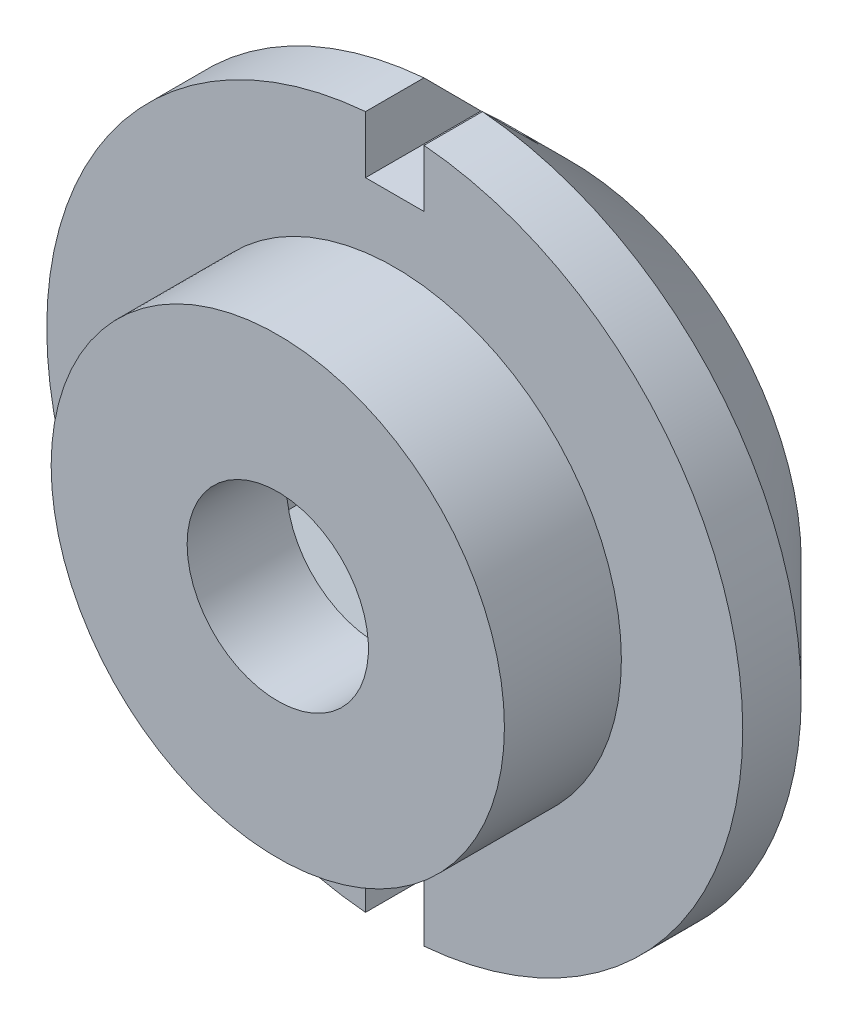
ISO-10303-21;
HEADER;
FILE_DESCRIPTION(('STEP AP214'),'2;1');
FILE_NAME('part.step','',(''),(''),'','','');
FILE_SCHEMA(('AUTOMOTIVE_DESIGN { 1 0 10303 214 1 1 1 1 }'));
ENDSEC;
DATA;
#1=APPLICATION_CONTEXT('core data for automotive mechanical design processes');
#2=APPLICATION_PROTOCOL_DEFINITION('international standard','automotive_design',2000,#1);
#3=PRODUCT_CONTEXT('',#1,'mechanical');
#4=PRODUCT('Part','Part','',(#3));
#5=PRODUCT_RELATED_PRODUCT_CATEGORY('part','',(#4));
#6=PRODUCT_DEFINITION_FORMATION('','',#4);
#7=PRODUCT_DEFINITION_CONTEXT('part definition',#1,'design');
#8=PRODUCT_DEFINITION('design','',#6,#7);
#9=PRODUCT_DEFINITION_SHAPE('','',#8);
#10=(LENGTH_UNIT() NAMED_UNIT(*) SI_UNIT(.MILLI.,.METRE.));
#11=(NAMED_UNIT(*) PLANE_ANGLE_UNIT() SI_UNIT($,.RADIAN.));
#12=(NAMED_UNIT(*) SI_UNIT($,.STERADIAN.) SOLID_ANGLE_UNIT());
#13=UNCERTAINTY_MEASURE_WITH_UNIT(LENGTH_MEASURE(1.E-05),#10,'distance_accuracy_value','');
#14=(GEOMETRIC_REPRESENTATION_CONTEXT(3) GLOBAL_UNCERTAINTY_ASSIGNED_CONTEXT((#13)) GLOBAL_UNIT_ASSIGNED_CONTEXT((#10,
#11,#12)) REPRESENTATION_CONTEXT('',''));
#15=CARTESIAN_POINT('',(0.,0.,0.));
#16=DIRECTION('',(0.,0.,1.));
#17=DIRECTION('',(1.,0.,0.));
#18=AXIS2_PLACEMENT_3D('',#15,#16,#17);
#19=CARTESIAN_POINT('',(0.,0.,1.5));
#20=DIRECTION('',(0.,0.,-1.));
#21=DIRECTION('',(-1.,0.,0.));
#22=AXIS2_PLACEMENT_3D('',#19,#20,#21);
#23=CYLINDRICAL_SURFACE('',#22,5.95);
#24=CARTESIAN_POINT('',(0.,0.,0.5));
#25=DIRECTION('',(0.,0.,1.));
#26=DIRECTION('',(1.,0.,0.));
#27=AXIS2_PLACEMENT_3D('',#24,#25,#26);
#28=CIRCLE('',#27,5.95);
#29=CARTESIAN_POINT('',(-0.5,5.92895437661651,0.5));
#30=VERTEX_POINT('',#29);
#31=CARTESIAN_POINT('',(-0.5,-5.92895437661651,0.5));
#32=VERTEX_POINT('',#31);
#33=EDGE_CURVE('E255',#30,#32,#28,.T.);
#34=ORIENTED_EDGE('',*,*,#33,.T.);
#35=DIRECTION('',(0.,0.,-1.));
#36=VECTOR('',#35,1.);
#37=CARTESIAN_POINT('',(-0.5,-5.92895437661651,1.5));
#38=LINE('',#37,#36);
#39=CARTESIAN_POINT('',(-0.5,-5.92895437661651,1.5));
#40=VERTEX_POINT('',#39);
#41=EDGE_CURVE('E185',#32,#40,#38,.F.);
#42=ORIENTED_EDGE('',*,*,#41,.T.);
#43=CARTESIAN_POINT('',(0.,0.,1.5));
#44=DIRECTION('',(0.,0.,1.));
#45=DIRECTION('',(1.,0.,0.));
#46=AXIS2_PLACEMENT_3D('',#43,#44,#45);
#47=CIRCLE('',#46,5.95);
#48=CARTESIAN_POINT('',(-0.5,5.92895437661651,1.5));
#49=VERTEX_POINT('',#48);
#50=EDGE_CURVE('E251',#49,#40,#47,.T.);
#51=ORIENTED_EDGE('',*,*,#50,.F.);
#52=DIRECTION('',(0.,0.,-1.));
#53=VECTOR('',#52,1.);
#54=CARTESIAN_POINT('',(-0.5,5.92895437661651,1.5));
#55=LINE('',#54,#53);
#56=EDGE_CURVE('E156',#49,#30,#55,.T.);
#57=ORIENTED_EDGE('',*,*,#56,.T.);
#58=EDGE_LOOP('',(#34,#42,#51,#57));
#59=FACE_BOUND('',#58,.T.);
#60=ADVANCED_FACE('F38',(#59),#23,.T.);
#61=CARTESIAN_POINT('',(0.5,-5.92895437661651,1.5));
#62=VERTEX_POINT('',#61);
#63=CARTESIAN_POINT('',(0.5,5.92895437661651,1.5));
#64=VERTEX_POINT('',#63);
#65=EDGE_CURVE('E168',#62,#64,#47,.T.);
#66=ORIENTED_EDGE('',*,*,#65,.F.);
#67=DIRECTION('',(0.,0.,-1.));
#68=VECTOR('',#67,1.);
#69=CARTESIAN_POINT('',(0.5,-5.92895437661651,1.5));
#70=LINE('',#69,#68);
#71=CARTESIAN_POINT('',(0.5,-5.92895437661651,0.5));
#72=VERTEX_POINT('',#71);
#73=EDGE_CURVE('E180',#62,#72,#70,.T.);
#74=ORIENTED_EDGE('',*,*,#73,.T.);
#75=CARTESIAN_POINT('',(0.5,5.92895437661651,0.5));
#76=VERTEX_POINT('',#75);
#77=EDGE_CURVE('E250',#72,#76,#28,.T.);
#78=ORIENTED_EDGE('',*,*,#77,.T.);
#79=DIRECTION('',(0.,0.,-1.));
#80=VECTOR('',#79,1.);
#81=CARTESIAN_POINT('',(0.5,5.92895437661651,1.5));
#82=LINE('',#81,#80);
#83=EDGE_CURVE('E67',#76,#64,#82,.F.);
#84=ORIENTED_EDGE('',*,*,#83,.T.);
#85=EDGE_LOOP('',(#66,#74,#78,#84));
#86=FACE_BOUND('',#85,.T.);
#87=ADVANCED_FACE('F324',(#86),#23,.T.);
#88=CARTESIAN_POINT('',(0.,0.,1.5));
#89=DIRECTION('',(0.,0.,1.));
#90=DIRECTION('',(1.,0.,0.));
#91=AXIS2_PLACEMENT_3D('',#88,#89,#90);
#92=PLANE('',#91);
#93=DIRECTION('',(0.,-1.,0.));
#94=VECTOR('',#93,1.);
#95=CARTESIAN_POINT('',(-0.5,0.,1.5));
#96=LINE('',#95,#94);
#97=CARTESIAN_POINT('',(-0.5,-4.95,1.5));
#98=VERTEX_POINT('',#97);
#99=EDGE_CURVE('E188',#98,#40,#96,.T.);
#100=ORIENTED_EDGE('',*,*,#99,.F.);
#101=DIRECTION('',(-1.,0.,0.));
#102=VECTOR('',#101,1.);
#103=CARTESIAN_POINT('',(0.,-4.95,1.5));
#104=LINE('',#103,#102);
#105=CARTESIAN_POINT('',(0.5,-4.95,1.5));
#106=VERTEX_POINT('',#105);
#107=EDGE_CURVE('E178',#106,#98,#104,.T.);
#108=ORIENTED_EDGE('',*,*,#107,.F.);
#109=DIRECTION('',(0.,1.,0.));
#110=VECTOR('',#109,1.);
#111=CARTESIAN_POINT('',(0.5,0.,1.5));
#112=LINE('',#111,#110);
#113=EDGE_CURVE('E183',#62,#106,#112,.T.);
#114=ORIENTED_EDGE('',*,*,#113,.F.);
#115=ORIENTED_EDGE('',*,*,#65,.T.);
#116=DIRECTION('',(0.,1.,0.));
#117=VECTOR('',#116,1.);
#118=CARTESIAN_POINT('',(0.5,0.,1.5));
#119=LINE('',#118,#117);
#120=CARTESIAN_POINT('',(0.5,4.95,1.5));
#121=VERTEX_POINT('',#120);
#122=EDGE_CURVE('E157',#121,#64,#119,.T.);
#123=ORIENTED_EDGE('',*,*,#122,.F.);
#124=DIRECTION('',(1.,0.,0.));
#125=VECTOR('',#124,1.);
#126=CARTESIAN_POINT('',(0.,4.95,1.5));
#127=LINE('',#126,#125);
#128=CARTESIAN_POINT('',(-0.5,4.95,1.5));
#129=VERTEX_POINT('',#128);
#130=EDGE_CURVE('E146',#129,#121,#127,.T.);
#131=ORIENTED_EDGE('',*,*,#130,.F.);
#132=DIRECTION('',(0.,-1.,0.));
#133=VECTOR('',#132,1.);
#134=CARTESIAN_POINT('',(-0.5,0.,1.5));
#135=LINE('',#134,#133);
#136=EDGE_CURVE('E176',#49,#129,#135,.T.);
#137=ORIENTED_EDGE('',*,*,#136,.F.);
#138=ORIENTED_EDGE('',*,*,#50,.T.);
#139=EDGE_LOOP('',(#100,#108,#114,#115,#123,#131,#137,#138));
#140=FACE_BOUND('',#139,.T.);
#141=CARTESIAN_POINT('',(0.,0.,1.5));
#142=DIRECTION('',(0.,0.,1.));
#143=DIRECTION('',(1.,0.,0.));
#144=AXIS2_PLACEMENT_3D('',#141,#142,#143);
#145=CIRCLE('',#144,3.875);
#146=CARTESIAN_POINT('',(3.875,0.,1.5));
#147=VERTEX_POINT('',#146);
#148=EDGE_CURVE('E247',#147,#147,#145,.T.);
#149=ORIENTED_EDGE('',*,*,#148,.F.);
#150=EDGE_LOOP('',(#149));
#151=FACE_BOUND('',#150,.T.);
#152=ADVANCED_FACE('F164',(#140,#151),#92,.T.);
#153=CARTESIAN_POINT('',(0.,0.,-1.5));
#154=DIRECTION('',(0.,0.,1.));
#155=DIRECTION('',(1.,0.,0.));
#156=AXIS2_PLACEMENT_3D('',#153,#154,#155);
#157=PLANE('',#156);
#158=DIRECTION('',(0.866025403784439,-0.5,0.));
#159=VECTOR('',#158,1.);
#160=CARTESIAN_POINT('',(0.,3.25,-1.5));
#161=LINE('',#160,#159);
#162=CARTESIAN_POINT('',(0.,3.25,-1.5));
#163=VERTEX_POINT('',#162);
#164=CARTESIAN_POINT('',(2.81458256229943,1.625,-1.5));
#165=VERTEX_POINT('',#164);
#166=EDGE_CURVE('E218',#163,#165,#161,.T.);
#167=ORIENTED_EDGE('',*,*,#166,.F.);
#168=DIRECTION('',(0.866025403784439,0.5,0.));
#169=VECTOR('',#168,1.);
#170=CARTESIAN_POINT('',(-2.81458256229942,1.625,-1.5));
#171=LINE('',#170,#169);
#172=CARTESIAN_POINT('',(-2.81458256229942,1.625,-1.5));
#173=VERTEX_POINT('',#172);
#174=EDGE_CURVE('E194',#173,#163,#171,.T.);
#175=ORIENTED_EDGE('',*,*,#174,.F.);
#176=DIRECTION('',(0.,1.,0.));
#177=VECTOR('',#176,1.);
#178=CARTESIAN_POINT('',(-2.81458256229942,-1.625,-1.5));
#179=LINE('',#178,#177);
#180=CARTESIAN_POINT('',(-2.81458256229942,-1.625,-1.5));
#181=VERTEX_POINT('',#180);
#182=EDGE_CURVE('E201',#181,#173,#179,.T.);
#183=ORIENTED_EDGE('',*,*,#182,.F.);
#184=DIRECTION('',(-0.866025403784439,0.5,0.));
#185=VECTOR('',#184,1.);
#186=CARTESIAN_POINT('',(0.,-3.25,-1.5));
#187=LINE('',#186,#185);
#188=CARTESIAN_POINT('',(0.,-3.25,-1.5));
#189=VERTEX_POINT('',#188);
#190=EDGE_CURVE('E227',#189,#181,#187,.T.);
#191=ORIENTED_EDGE('',*,*,#190,.F.);
#192=DIRECTION('',(-0.866025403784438,-0.5,0.));
#193=VECTOR('',#192,1.);
#194=CARTESIAN_POINT('',(2.81458256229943,-1.625,-1.5));
#195=LINE('',#194,#193);
#196=CARTESIAN_POINT('',(2.81458256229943,-1.625,-1.5));
#197=VERTEX_POINT('',#196);
#198=EDGE_CURVE('E224',#197,#189,#195,.T.);
#199=ORIENTED_EDGE('',*,*,#198,.F.);
#200=DIRECTION('',(0.,-1.,0.));
#201=VECTOR('',#200,1.);
#202=CARTESIAN_POINT('',(2.81458256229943,1.625,-1.5));
#203=LINE('',#202,#201);
#204=EDGE_CURVE('E221',#165,#197,#203,.T.);
#205=ORIENTED_EDGE('',*,*,#204,.F.);
#206=EDGE_LOOP('',(#167,#175,#183,#191,#199,#205));
#207=FACE_BOUND('',#206,.T.);
#208=CARTESIAN_POINT('',(0.,0.,-1.5));
#209=DIRECTION('',(0.,0.,1.));
#210=DIRECTION('',(1.,0.,0.));
#211=AXIS2_PLACEMENT_3D('',#208,#209,#210);
#212=CIRCLE('',#211,3.95);
#213=CARTESIAN_POINT('',(3.95,0.,-1.5));
#214=VERTEX_POINT('',#213);
#215=EDGE_CURVE('E256',#214,#214,#212,.F.);
#216=ORIENTED_EDGE('',*,*,#215,.T.);
#217=EDGE_LOOP('',(#216));
#218=FACE_BOUND('',#217,.T.);
#219=ADVANCED_FACE('F320',(#207,#218),#157,.F.);
#220=CARTESIAN_POINT('',(0.,0.,3.5));
#221=DIRECTION('',(0.,0.,-1.));
#222=DIRECTION('',(-1.,0.,0.));
#223=AXIS2_PLACEMENT_3D('',#220,#221,#222);
#224=CYLINDRICAL_SURFACE('',#223,3.875);
#225=CARTESIAN_POINT('',(0.,0.,3.5));
#226=DIRECTION('',(0.,0.,1.));
#227=DIRECTION('',(1.,0.,0.));
#228=AXIS2_PLACEMENT_3D('',#225,#226,#227);
#229=CIRCLE('',#228,3.875);
#230=CARTESIAN_POINT('',(3.875,0.,3.5));
#231=VERTEX_POINT('',#230);
#232=EDGE_CURVE('E234',#231,#231,#229,.T.);
#233=ORIENTED_EDGE('',*,*,#232,.F.);
#234=EDGE_LOOP('',(#233));
#235=FACE_BOUND('',#234,.T.);
#236=ORIENTED_EDGE('',*,*,#148,.T.);
#237=EDGE_LOOP('',(#236));
#238=FACE_BOUND('',#237,.T.);
#239=ADVANCED_FACE('F316',(#235,#238),#224,.T.);
#240=CARTESIAN_POINT('',(0.,0.,3.5));
#241=DIRECTION('',(0.,0.,1.));
#242=DIRECTION('',(1.,0.,0.));
#243=AXIS2_PLACEMENT_3D('',#240,#241,#242);
#244=PLANE('',#243);
#245=CARTESIAN_POINT('',(0.,0.,3.5));
#246=DIRECTION('',(0.,0.,-1.));
#247=DIRECTION('',(-1.,0.,0.));
#248=AXIS2_PLACEMENT_3D('',#245,#246,#247);
#249=CIRCLE('',#248,1.55);
#250=CARTESIAN_POINT('',(-1.55,0.,3.5));
#251=VERTEX_POINT('',#250);
#252=EDGE_CURVE('E191',#251,#251,#249,.T.);
#253=ORIENTED_EDGE('',*,*,#252,.T.);
#254=EDGE_LOOP('',(#253));
#255=FACE_BOUND('',#254,.T.);
#256=ORIENTED_EDGE('',*,*,#232,.T.);
#257=EDGE_LOOP('',(#256));
#258=FACE_BOUND('',#257,.T.);
#259=ADVANCED_FACE('F313',(#255,#258),#244,.T.);
#260=CARTESIAN_POINT('',(0.,0.,0.5));
#261=DIRECTION('',(0.,0.,1.));
#262=DIRECTION('',(1.,0.,0.));
#263=AXIS2_PLACEMENT_3D('',#260,#261,#262);
#264=CONICAL_SURFACE('',#263,5.95,0.78539816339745);
#265=CARTESIAN_POINT('',(-0.5,-8.17098423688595,2.73626797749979));
#266=CARTESIAN_POINT('',(-0.5,-7.71703063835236,2.28320845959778));
#267=CARTESIAN_POINT('',(-0.5,-7.26304841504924,1.8301773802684));
#268=CARTESIAN_POINT('',(-0.5,-6.3548317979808,0.924369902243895));
#269=CARTESIAN_POINT('',(-0.5,-5.90059740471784,0.471593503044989));
#270=CARTESIAN_POINT('',(-0.5,-5.21890848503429,-0.207233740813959));
#271=CARTESIAN_POINT('',(-0.5,-4.99162229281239,-0.433453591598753));
#272=CARTESIAN_POINT('',(-0.5,-4.53687572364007,-0.885717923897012));
#273=CARTESIAN_POINT('',(-0.5,-4.30941534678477,-1.11176240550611));
#274=CARTESIAN_POINT('',(-0.5,-3.85422354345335,-1.56357955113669));
#275=CARTESIAN_POINT('',(-0.5,-3.62649211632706,-1.78935221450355));
#276=CARTESIAN_POINT('',(-0.5,-3.28454462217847,-2.12765761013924));
#277=CARTESIAN_POINT('',(-0.5,-3.17050362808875,-2.24036724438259));
#278=CARTESIAN_POINT('',(-0.5,-2.94225511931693,-2.4656179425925));
#279=CARTESIAN_POINT('',(-0.5,-2.82804760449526,-2.57815900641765));
#280=CARTESIAN_POINT('',(-0.5,-2.71373202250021,-2.69059037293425));
#281=B_SPLINE_CURVE_WITH_KNOTS('',3,(#265,#266,#267,#268,#269,#270,#271,#272,#273,#274,#275,
#276,#277,#278,#279,#280),.UNSPECIFIED.,.F.,.F.,(4,2,2,2,2,2,2,4),(0.,1.92406659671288,
3.84812937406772,4.8101635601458,5.77219722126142,6.73423319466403,7.21525205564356,
7.69627131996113),.UNSPECIFIED.);
#282=CARTESIAN_POINT('',(-0.500000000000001,-4.95,-0.474811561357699));
#283=VERTEX_POINT('',#282);
#284=EDGE_CURVE('E11',#32,#283,#281,.T.);
#285=ORIENTED_EDGE('',*,*,#284,.F.);
#286=ORIENTED_EDGE('',*,*,#33,.F.);
#287=CARTESIAN_POINT('',(-0.5,2.71373202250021,-2.69059037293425));
#288=CARTESIAN_POINT('',(-0.5,2.9057894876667,-2.50166112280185));
#289=CARTESIAN_POINT('',(-0.5,3.0975722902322,-2.31245347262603));
#290=CARTESIAN_POINT('',(-0.5,3.48075238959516,-1.93364875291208));
#291=CARTESIAN_POINT('',(-0.5,3.6721496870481,-1.74405168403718));
#292=CARTESIAN_POINT('',(-0.5,4.05472280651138,-1.36463530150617));
#293=CARTESIAN_POINT('',(-0.5,4.24589862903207,-1.17481598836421));
#294=CARTESIAN_POINT('',(-0.5,4.62809640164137,-0.795022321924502));
#295=CARTESIAN_POINT('',(-0.5,4.81911835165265,-0.605047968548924));
#296=CARTESIAN_POINT('',(-0.5,5.53740915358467,0.109685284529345));
#297=CARTESIAN_POINT('',(-0.5,6.06434177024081,0.634782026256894));
#298=CARTESIAN_POINT('',(-0.5,6.85449168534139,1.42267816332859));
#299=CARTESIAN_POINT('',(-0.5,7.11783386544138,1.68535242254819));
#300=CARTESIAN_POINT('',(-0.5,7.64445321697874,2.21076598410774));
#301=CARTESIAN_POINT('',(-0.5,7.90773038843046,2.47350528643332));
#302=CARTESIAN_POINT('',(-0.499999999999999,8.17098423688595,2.73626797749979));
#303=B_SPLINE_CURVE_WITH_KNOTS('',3,(#287,#288,#289,#290,#291,#292,#293,#294,#295,#296,#297,
#298,#299,#300,#301,#302),.UNSPECIFIED.,.F.,.F.,(4,2,2,2,2,2,2,4),(0.,0.808221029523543,
1.61644068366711,2.42465847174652,3.23287666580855,5.46457084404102,6.58042112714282,
7.69627116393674),.UNSPECIFIED.);
#304=CARTESIAN_POINT('',(-0.5,4.95,-0.474811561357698));
#305=VERTEX_POINT('',#304);
#306=EDGE_CURVE('E341',#305,#30,#303,.T.);
#307=ORIENTED_EDGE('',*,*,#306,.F.);
#308=CARTESIAN_POINT('',(2.73626797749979,4.95,0.205940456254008));
#309=CARTESIAN_POINT('',(2.54686897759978,4.95,0.11437680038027));
#310=CARTESIAN_POINT('',(2.35437597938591,4.95,0.0284706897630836));
#311=CARTESIAN_POINT('',(1.96226783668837,4.95,-0.128312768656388));
#312=CARTESIAN_POINT('',(1.76262116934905,4.95,-0.19911059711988));
#313=CARTESIAN_POINT('',(1.36013508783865,4.95,-0.320061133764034));
#314=CARTESIAN_POINT('',(1.15738288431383,4.95,-0.37049611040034));
#315=CARTESIAN_POINT('',(0.747761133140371,4.95,-0.447858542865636));
#316=CARTESIAN_POINT('',(0.540901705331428,4.95,-0.474837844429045));
#317=CARTESIAN_POINT('',(0.17846488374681,4.95,-0.499198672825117));
#318=CARTESIAN_POINT('',(0.0232630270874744,4.95,-0.502373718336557));
#319=CARTESIAN_POINT('',(-0.286810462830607,4.95,-0.494118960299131));
#320=CARTESIAN_POINT('',(-0.441681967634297,4.95,-0.482684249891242));
#321=CARTESIAN_POINT('',(-0.749872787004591,4.95,-0.445866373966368));
#322=CARTESIAN_POINT('',(-0.903190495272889,4.95,-0.42047002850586));
#323=CARTESIAN_POINT('',(-1.20715818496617,4.95,-0.357100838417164));
#324=CARTESIAN_POINT('',(-1.35780840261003,4.95,-0.319129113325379));
#325=CARTESIAN_POINT('',(-1.61280977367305,4.95,-0.244871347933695));
#326=CARTESIAN_POINT('',(-1.71795950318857,4.95,-0.211269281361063));
#327=CARTESIAN_POINT('',(-1.92656749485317,4.95,-0.139201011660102));
#328=CARTESIAN_POINT('',(-2.03002588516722,4.95,-0.100735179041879));
#329=CARTESIAN_POINT('',(-2.23491090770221,4.95,-0.0196690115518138));
#330=CARTESIAN_POINT('',(-2.33634302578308,4.95,0.0229175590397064));
#331=CARTESIAN_POINT('',(-2.53753600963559,4.95,0.11178664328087));
#332=CARTESIAN_POINT('',(-2.63729744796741,4.95,0.158067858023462));
#333=CARTESIAN_POINT('',(-2.73626797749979,4.95,0.205940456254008));
#334=B_SPLINE_CURVE_WITH_KNOTS('',3,(#308,#309,#310,#311,#312,#313,#314,#315,#316,#317,#318,
#319,#320,#321,#322,#323,#324,#325,#326,#327,#328,#329,#330,#331,#332,#333),.UNSPECIFIED.,.F.,
.F.,(4,2,2,2,2,2,2,2,2,2,2,2,4),(0.,0.631508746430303,1.26626352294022,1.89188945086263,
2.5161289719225,2.98117104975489,3.44636935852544,3.91200757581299,4.3776043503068,
4.70865054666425,5.03967153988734,5.36962269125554,5.69945834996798),.UNSPECIFIED.);
#335=CARTESIAN_POINT('',(0.5,4.95,-0.474811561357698));
#336=VERTEX_POINT('',#335);
#337=EDGE_CURVE('E265',#336,#305,#334,.T.);
#338=ORIENTED_EDGE('',*,*,#337,.F.);
#339=CARTESIAN_POINT('',(0.500000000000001,8.17098423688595,2.73626797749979));
#340=CARTESIAN_POINT('',(0.500000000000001,7.71703063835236,2.28320845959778));
#341=CARTESIAN_POINT('',(0.500000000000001,7.26304841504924,1.8301773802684));
#342=CARTESIAN_POINT('',(0.5,6.3548317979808,0.924369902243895));
#343=CARTESIAN_POINT('',(0.5,5.90059740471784,0.47159350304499));
#344=CARTESIAN_POINT('',(0.5,5.21890848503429,-0.207233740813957));
#345=CARTESIAN_POINT('',(0.5,4.99162229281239,-0.433453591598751));
#346=CARTESIAN_POINT('',(0.5,4.53687572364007,-0.885717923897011));
#347=CARTESIAN_POINT('',(0.5,4.30941534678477,-1.11176240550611));
#348=CARTESIAN_POINT('',(0.5,3.85422354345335,-1.56357955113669));
#349=CARTESIAN_POINT('',(0.5,3.62649211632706,-1.78935221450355));
#350=CARTESIAN_POINT('',(0.5,3.28454462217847,-2.12765761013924));
#351=CARTESIAN_POINT('',(0.5,3.17050362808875,-2.24036724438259));
#352=CARTESIAN_POINT('',(0.5,2.94225511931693,-2.4656179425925));
#353=CARTESIAN_POINT('',(0.5,2.82804760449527,-2.57815900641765));
#354=CARTESIAN_POINT('',(0.5,2.71373202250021,-2.69059037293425));
#355=B_SPLINE_CURVE_WITH_KNOTS('',3,(#339,#340,#341,#342,#343,#344,#345,#346,#347,#348,#349,
#350,#351,#352,#353,#354),.UNSPECIFIED.,.F.,.F.,(4,2,2,2,2,2,2,4),(0.,1.92406659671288,
3.84812937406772,4.8101635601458,5.77219722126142,6.73423319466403,7.21525205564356,
7.69627131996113),.UNSPECIFIED.);
#356=EDGE_CURVE('E160',#76,#336,#355,.T.);
#357=ORIENTED_EDGE('',*,*,#356,.F.);
#358=ORIENTED_EDGE('',*,*,#77,.F.);
#359=CARTESIAN_POINT('',(0.5,-2.71373202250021,-2.69059037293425));
#360=CARTESIAN_POINT('',(0.5,-2.9057894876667,-2.50166112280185));
#361=CARTESIAN_POINT('',(0.5,-3.0975722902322,-2.31245347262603));
#362=CARTESIAN_POINT('',(0.5,-3.48075238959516,-1.93364875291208));
#363=CARTESIAN_POINT('',(0.5,-3.6721496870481,-1.74405168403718));
#364=CARTESIAN_POINT('',(0.5,-4.05472280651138,-1.36463530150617));
#365=CARTESIAN_POINT('',(0.5,-4.24589862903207,-1.17481598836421));
#366=CARTESIAN_POINT('',(0.5,-4.62809640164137,-0.795022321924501));
#367=CARTESIAN_POINT('',(0.5,-4.81911835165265,-0.605047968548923));
#368=CARTESIAN_POINT('',(0.5,-5.53740915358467,0.109685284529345));
#369=CARTESIAN_POINT('',(0.5,-6.06434177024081,0.634782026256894));
#370=CARTESIAN_POINT('',(0.5,-6.85449168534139,1.42267816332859));
#371=CARTESIAN_POINT('',(0.5,-7.11783386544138,1.68535242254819));
#372=CARTESIAN_POINT('',(0.5,-7.64445321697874,2.21076598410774));
#373=CARTESIAN_POINT('',(0.5,-7.90773038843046,2.47350528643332));
#374=CARTESIAN_POINT('',(0.5,-8.17098423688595,2.73626797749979));
#375=B_SPLINE_CURVE_WITH_KNOTS('',3,(#359,#360,#361,#362,#363,#364,#365,#366,#367,#368,#369,
#370,#371,#372,#373,#374),.UNSPECIFIED.,.F.,.F.,(4,2,2,2,2,2,2,4),(0.,0.808221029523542,
1.61644068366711,2.42465847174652,3.23287666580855,5.46457084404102,6.58042112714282,
7.69627116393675),.UNSPECIFIED.);
#376=CARTESIAN_POINT('',(0.5,-4.95,-0.474811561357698));
#377=VERTEX_POINT('',#376);
#378=EDGE_CURVE('E53',#377,#72,#375,.T.);
#379=ORIENTED_EDGE('',*,*,#378,.F.);
#380=CARTESIAN_POINT('',(-2.73626797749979,-4.95,0.205940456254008));
#381=CARTESIAN_POINT('',(-2.54686897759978,-4.95,0.11437680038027));
#382=CARTESIAN_POINT('',(-2.35437597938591,-4.95,0.0284706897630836));
#383=CARTESIAN_POINT('',(-1.96226783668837,-4.95,-0.128312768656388));
#384=CARTESIAN_POINT('',(-1.76262116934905,-4.95,-0.19911059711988));
#385=CARTESIAN_POINT('',(-1.36013508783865,-4.95,-0.320061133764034));
#386=CARTESIAN_POINT('',(-1.15738288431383,-4.95,-0.37049611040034));
#387=CARTESIAN_POINT('',(-0.747761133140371,-4.95,-0.447858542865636));
#388=CARTESIAN_POINT('',(-0.540901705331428,-4.95,-0.474837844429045));
#389=CARTESIAN_POINT('',(-0.17846488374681,-4.95,-0.499198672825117));
#390=CARTESIAN_POINT('',(-0.0232630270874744,-4.95,-0.502373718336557));
#391=CARTESIAN_POINT('',(0.286810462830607,-4.95,-0.494118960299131));
#392=CARTESIAN_POINT('',(0.441681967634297,-4.95,-0.482684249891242));
#393=CARTESIAN_POINT('',(0.749872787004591,-4.95,-0.445866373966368));
#394=CARTESIAN_POINT('',(0.903190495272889,-4.95,-0.42047002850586));
#395=CARTESIAN_POINT('',(1.20715818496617,-4.95,-0.357100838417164));
#396=CARTESIAN_POINT('',(1.35780840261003,-4.95,-0.319129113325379));
#397=CARTESIAN_POINT('',(1.61280977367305,-4.95,-0.244871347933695));
#398=CARTESIAN_POINT('',(1.71795950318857,-4.95,-0.211269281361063));
#399=CARTESIAN_POINT('',(1.92656749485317,-4.95,-0.139201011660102));
#400=CARTESIAN_POINT('',(2.03002588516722,-4.95,-0.100735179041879));
#401=CARTESIAN_POINT('',(2.23491090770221,-4.95,-0.0196690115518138));
#402=CARTESIAN_POINT('',(2.33634302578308,-4.95,0.0229175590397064));
#403=CARTESIAN_POINT('',(2.53753600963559,-4.95,0.11178664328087));
#404=CARTESIAN_POINT('',(2.63729744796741,-4.95,0.158067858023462));
#405=CARTESIAN_POINT('',(2.73626797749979,-4.95,0.205940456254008));
#406=B_SPLINE_CURVE_WITH_KNOTS('',3,(#380,#381,#382,#383,#384,#385,#386,#387,#388,#389,#390,
#391,#392,#393,#394,#395,#396,#397,#398,#399,#400,#401,#402,#403,#404,#405),.UNSPECIFIED.,.F.,
.F.,(4,2,2,2,2,2,2,2,2,2,2,2,4),(0.,0.631508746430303,1.26626352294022,1.89188945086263,
2.5161289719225,2.98117104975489,3.44636935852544,3.91200757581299,4.3776043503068,
4.70865054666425,5.03967153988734,5.36962269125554,5.69945834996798),.UNSPECIFIED.);
#407=EDGE_CURVE('E342',#283,#377,#406,.T.);
#408=ORIENTED_EDGE('',*,*,#407,.F.);
#409=EDGE_LOOP('',(#285,#286,#307,#338,#357,#358,#379,#408));
#410=FACE_BOUND('',#409,.T.);
#411=ORIENTED_EDGE('',*,*,#215,.F.);
#412=EDGE_LOOP('',(#411));
#413=FACE_BOUND('',#412,.T.);
#414=ADVANCED_FACE('F41',(#410,#413),#264,.T.);
#415=CARTESIAN_POINT('',(-2.81458256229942,1.625,1.8));
#416=DIRECTION('',(-0.5,0.866025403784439,0.));
#417=DIRECTION('',(-0.866025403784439,-0.5,0.));
#418=AXIS2_PLACEMENT_3D('',#415,#416,#417);
#419=PLANE('',#418);
#420=ORIENTED_EDGE('',*,*,#174,.T.);
#421=DIRECTION('',(0.,0.,-1.));
#422=VECTOR('',#421,1.);
#423=CARTESIAN_POINT('',(0.,3.25,1.8));
#424=LINE('',#423,#422);
#425=CARTESIAN_POINT('',(0.,3.25,1.8));
#426=VERTEX_POINT('',#425);
#427=EDGE_CURVE('E216',#426,#163,#424,.T.);
#428=ORIENTED_EDGE('',*,*,#427,.F.);
#429=DIRECTION('',(0.866025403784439,0.5,0.));
#430=VECTOR('',#429,1.);
#431=CARTESIAN_POINT('',(-2.81458256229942,1.625,1.8));
#432=LINE('',#431,#430);
#433=CARTESIAN_POINT('',(-2.81458256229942,1.625,1.8));
#434=VERTEX_POINT('',#433);
#435=EDGE_CURVE('E197',#434,#426,#432,.T.);
#436=ORIENTED_EDGE('',*,*,#435,.F.);
#437=DIRECTION('',(0.,0.,-1.));
#438=VECTOR('',#437,1.);
#439=CARTESIAN_POINT('',(-2.81458256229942,1.625,1.8));
#440=LINE('',#439,#438);
#441=EDGE_CURVE('E232',#434,#173,#440,.T.);
#442=ORIENTED_EDGE('',*,*,#441,.T.);
#443=EDGE_LOOP('',(#420,#428,#436,#442));
#444=FACE_BOUND('',#443,.T.);
#445=ADVANCED_FACE('F294',(#444),#419,.F.);
#446=CARTESIAN_POINT('',(-2.81458256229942,-1.625,1.8));
#447=DIRECTION('',(-1.,0.,0.));
#448=DIRECTION('',(0.,-1.,0.));
#449=AXIS2_PLACEMENT_3D('',#446,#447,#448);
#450=PLANE('',#449);
#451=ORIENTED_EDGE('',*,*,#182,.T.);
#452=ORIENTED_EDGE('',*,*,#441,.F.);
#453=DIRECTION('',(0.,1.,0.));
#454=VECTOR('',#453,1.);
#455=CARTESIAN_POINT('',(-2.81458256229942,-1.625,1.8));
#456=LINE('',#455,#454);
#457=CARTESIAN_POINT('',(-2.81458256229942,-1.625,1.8));
#458=VERTEX_POINT('',#457);
#459=EDGE_CURVE('E213',#458,#434,#456,.T.);
#460=ORIENTED_EDGE('',*,*,#459,.F.);
#461=DIRECTION('',(0.,0.,-1.));
#462=VECTOR('',#461,1.);
#463=CARTESIAN_POINT('',(-2.81458256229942,-1.625,1.8));
#464=LINE('',#463,#462);
#465=EDGE_CURVE('E235',#458,#181,#464,.T.);
#466=ORIENTED_EDGE('',*,*,#465,.T.);
#467=EDGE_LOOP('',(#451,#452,#460,#466));
#468=FACE_BOUND('',#467,.T.);
#469=ADVANCED_FACE('F290',(#468),#450,.F.);
#470=CARTESIAN_POINT('',(0.,-3.25,1.8));
#471=DIRECTION('',(-0.5,-0.866025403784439,0.));
#472=DIRECTION('',(0.866025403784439,-0.5,0.));
#473=AXIS2_PLACEMENT_3D('',#470,#471,#472);
#474=PLANE('',#473);
#475=ORIENTED_EDGE('',*,*,#190,.T.);
#476=ORIENTED_EDGE('',*,*,#465,.F.);
#477=DIRECTION('',(-0.866025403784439,0.5,0.));
#478=VECTOR('',#477,1.);
#479=CARTESIAN_POINT('',(0.,-3.25,1.8));
#480=LINE('',#479,#478);
#481=CARTESIAN_POINT('',(0.,-3.25,1.8));
#482=VERTEX_POINT('',#481);
#483=EDGE_CURVE('E210',#482,#458,#480,.T.);
#484=ORIENTED_EDGE('',*,*,#483,.F.);
#485=DIRECTION('',(0.,0.,-1.));
#486=VECTOR('',#485,1.);
#487=CARTESIAN_POINT('',(0.,-3.25,1.8));
#488=LINE('',#487,#486);
#489=EDGE_CURVE('E237',#482,#189,#488,.T.);
#490=ORIENTED_EDGE('',*,*,#489,.T.);
#491=EDGE_LOOP('',(#475,#476,#484,#490));
#492=FACE_BOUND('',#491,.T.);
#493=ADVANCED_FACE('F293',(#492),#474,.F.);
#494=CARTESIAN_POINT('',(2.81458256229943,-1.625,1.8));
#495=DIRECTION('',(0.5,-0.866025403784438,0.));
#496=DIRECTION('',(0.866025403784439,0.5,0.));
#497=AXIS2_PLACEMENT_3D('',#494,#495,#496);
#498=PLANE('',#497);
#499=ORIENTED_EDGE('',*,*,#198,.T.);
#500=ORIENTED_EDGE('',*,*,#489,.F.);
#501=DIRECTION('',(-0.866025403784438,-0.5,0.));
#502=VECTOR('',#501,1.);
#503=CARTESIAN_POINT('',(2.81458256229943,-1.625,1.8));
#504=LINE('',#503,#502);
#505=CARTESIAN_POINT('',(2.81458256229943,-1.625,1.8));
#506=VERTEX_POINT('',#505);
#507=EDGE_CURVE('E207',#506,#482,#504,.T.);
#508=ORIENTED_EDGE('',*,*,#507,.F.);
#509=DIRECTION('',(0.,0.,-1.));
#510=VECTOR('',#509,1.);
#511=CARTESIAN_POINT('',(2.81458256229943,-1.625,1.8));
#512=LINE('',#511,#510);
#513=EDGE_CURVE('E239',#506,#197,#512,.T.);
#514=ORIENTED_EDGE('',*,*,#513,.T.);
#515=EDGE_LOOP('',(#499,#500,#508,#514));
#516=FACE_BOUND('',#515,.T.);
#517=ADVANCED_FACE('F298',(#516),#498,.F.);
#518=CARTESIAN_POINT('',(2.81458256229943,1.625,1.8));
#519=DIRECTION('',(1.,0.,0.));
#520=DIRECTION('',(0.,1.,0.));
#521=AXIS2_PLACEMENT_3D('',#518,#519,#520);
#522=PLANE('',#521);
#523=ORIENTED_EDGE('',*,*,#204,.T.);
#524=ORIENTED_EDGE('',*,*,#513,.F.);
#525=DIRECTION('',(0.,-1.,0.));
#526=VECTOR('',#525,1.);
#527=CARTESIAN_POINT('',(2.81458256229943,1.625,1.8));
#528=LINE('',#527,#526);
#529=CARTESIAN_POINT('',(2.81458256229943,1.625,1.8));
#530=VERTEX_POINT('',#529);
#531=EDGE_CURVE('E204',#530,#506,#528,.T.);
#532=ORIENTED_EDGE('',*,*,#531,.F.);
#533=DIRECTION('',(0.,0.,-1.));
#534=VECTOR('',#533,1.);
#535=CARTESIAN_POINT('',(2.81458256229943,1.625,1.8));
#536=LINE('',#535,#534);
#537=EDGE_CURVE('E241',#530,#165,#536,.T.);
#538=ORIENTED_EDGE('',*,*,#537,.T.);
#539=EDGE_LOOP('',(#523,#524,#532,#538));
#540=FACE_BOUND('',#539,.T.);
#541=ADVANCED_FACE('F302',(#540),#522,.F.);
#542=CARTESIAN_POINT('',(0.,3.25,1.8));
#543=DIRECTION('',(0.5,0.866025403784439,0.));
#544=DIRECTION('',(-0.866025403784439,0.5,0.));
#545=AXIS2_PLACEMENT_3D('',#542,#543,#544);
#546=PLANE('',#545);
#547=ORIENTED_EDGE('',*,*,#166,.T.);
#548=ORIENTED_EDGE('',*,*,#537,.F.);
#549=DIRECTION('',(0.866025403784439,-0.5,0.));
#550=VECTOR('',#549,1.);
#551=CARTESIAN_POINT('',(0.,3.25,1.8));
#552=LINE('',#551,#550);
#553=EDGE_CURVE('E200',#426,#530,#552,.T.);
#554=ORIENTED_EDGE('',*,*,#553,.F.);
#555=ORIENTED_EDGE('',*,*,#427,.T.);
#556=EDGE_LOOP('',(#547,#548,#554,#555));
#557=FACE_BOUND('',#556,.T.);
#558=ADVANCED_FACE('F288',(#557),#546,.F.);
#559=CARTESIAN_POINT('',(0.,0.,1.8));
#560=DIRECTION('',(0.,0.,-1.));
#561=DIRECTION('',(-1.,0.,0.));
#562=AXIS2_PLACEMENT_3D('',#559,#560,#561);
#563=PLANE('',#562);
#564=CARTESIAN_POINT('',(0.,0.,1.8));
#565=DIRECTION('',(0.,0.,-1.));
#566=DIRECTION('',(-1.,0.,0.));
#567=AXIS2_PLACEMENT_3D('',#564,#565,#566);
#568=CIRCLE('',#567,1.55);
#569=CARTESIAN_POINT('',(-1.55,0.,1.8));
#570=VERTEX_POINT('',#569);
#571=EDGE_CURVE('E190',#570,#570,#568,.T.);
#572=ORIENTED_EDGE('',*,*,#571,.F.);
#573=EDGE_LOOP('',(#572));
#574=FACE_BOUND('',#573,.T.);
#575=ORIENTED_EDGE('',*,*,#435,.T.);
#576=ORIENTED_EDGE('',*,*,#553,.T.);
#577=ORIENTED_EDGE('',*,*,#531,.T.);
#578=ORIENTED_EDGE('',*,*,#507,.T.);
#579=ORIENTED_EDGE('',*,*,#483,.T.);
#580=ORIENTED_EDGE('',*,*,#459,.T.);
#581=EDGE_LOOP('',(#575,#576,#577,#578,#579,#580));
#582=FACE_BOUND('',#581,.T.);
#583=ADVANCED_FACE('F284',(#574,#582),#563,.T.);
#584=CARTESIAN_POINT('',(0.,0.,3.5));
#585=DIRECTION('',(0.,0.,-1.));
#586=DIRECTION('',(-1.,0.,0.));
#587=AXIS2_PLACEMENT_3D('',#584,#585,#586);
#588=CYLINDRICAL_SURFACE('',#587,1.55);
#589=ORIENTED_EDGE('',*,*,#252,.F.);
#590=EDGE_LOOP('',(#589));
#591=FACE_BOUND('',#590,.T.);
#592=ORIENTED_EDGE('',*,*,#571,.T.);
#593=EDGE_LOOP('',(#592));
#594=FACE_BOUND('',#593,.T.);
#595=ADVANCED_FACE('F281',(#591,#594),#588,.F.);
#596=CARTESIAN_POINT('',(-0.5,6.95,3.5));
#597=DIRECTION('',(-1.,0.,0.));
#598=DIRECTION('',(0.,-1.,0.));
#599=AXIS2_PLACEMENT_3D('',#596,#597,#598);
#600=PLANE('',#599);
#601=ORIENTED_EDGE('',*,*,#136,.T.);
#602=DIRECTION('',(0.,0.,-1.));
#603=VECTOR('',#602,1.);
#604=CARTESIAN_POINT('',(-0.5,4.95,3.5));
#605=LINE('',#604,#603);
#606=EDGE_CURVE('E152',#129,#305,#605,.T.);
#607=ORIENTED_EDGE('',*,*,#606,.T.);
#608=ORIENTED_EDGE('',*,*,#306,.T.);
#609=ORIENTED_EDGE('',*,*,#56,.F.);
#610=EDGE_LOOP('',(#601,#607,#608,#609));
#611=FACE_BOUND('',#610,.T.);
#612=ADVANCED_FACE('F276',(#611),#600,.F.);
#613=CARTESIAN_POINT('',(0.5,4.95,3.5));
#614=DIRECTION('',(0.,-1.,0.));
#615=DIRECTION('',(0.,0.,-1.));
#616=AXIS2_PLACEMENT_3D('',#613,#614,#615);
#617=PLANE('',#616);
#618=ORIENTED_EDGE('',*,*,#130,.T.);
#619=DIRECTION('',(0.,0.,-1.));
#620=VECTOR('',#619,1.);
#621=CARTESIAN_POINT('',(0.5,4.95,3.5));
#622=LINE('',#621,#620);
#623=EDGE_CURVE('E149',#121,#336,#622,.T.);
#624=ORIENTED_EDGE('',*,*,#623,.T.);
#625=ORIENTED_EDGE('',*,*,#337,.T.);
#626=ORIENTED_EDGE('',*,*,#606,.F.);
#627=EDGE_LOOP('',(#618,#624,#625,#626));
#628=FACE_BOUND('',#627,.T.);
#629=ADVANCED_FACE('F148',(#628),#617,.F.);
#630=CARTESIAN_POINT('',(0.5,6.95,3.5));
#631=DIRECTION('',(1.,0.,0.));
#632=DIRECTION('',(0.,1.,0.));
#633=AXIS2_PLACEMENT_3D('',#630,#631,#632);
#634=PLANE('',#633);
#635=ORIENTED_EDGE('',*,*,#122,.T.);
#636=ORIENTED_EDGE('',*,*,#83,.F.);
#637=ORIENTED_EDGE('',*,*,#356,.T.);
#638=ORIENTED_EDGE('',*,*,#623,.F.);
#639=EDGE_LOOP('',(#635,#636,#637,#638));
#640=FACE_BOUND('',#639,.T.);
#641=ADVANCED_FACE('F159',(#640),#634,.F.);
#642=CARTESIAN_POINT('',(-0.5,-4.95,3.5));
#643=DIRECTION('',(-1.,0.,0.));
#644=DIRECTION('',(0.,-1.,0.));
#645=AXIS2_PLACEMENT_3D('',#642,#643,#644);
#646=PLANE('',#645);
#647=ORIENTED_EDGE('',*,*,#99,.T.);
#648=ORIENTED_EDGE('',*,*,#41,.F.);
#649=ORIENTED_EDGE('',*,*,#284,.T.);
#650=DIRECTION('',(0.,0.,-1.));
#651=VECTOR('',#650,1.);
#652=CARTESIAN_POINT('',(-0.5,-4.95,3.5));
#653=LINE('',#652,#651);
#654=EDGE_CURVE('E60',#98,#283,#653,.T.);
#655=ORIENTED_EDGE('',*,*,#654,.F.);
#656=EDGE_LOOP('',(#647,#648,#649,#655));
#657=FACE_BOUND('',#656,.T.);
#658=ADVANCED_FACE('F275',(#657),#646,.F.);
#659=CARTESIAN_POINT('',(0.5,-4.95,3.5));
#660=DIRECTION('',(1.,0.,0.));
#661=DIRECTION('',(0.,1.,0.));
#662=AXIS2_PLACEMENT_3D('',#659,#660,#661);
#663=PLANE('',#662);
#664=ORIENTED_EDGE('',*,*,#113,.T.);
#665=DIRECTION('',(0.,0.,-1.));
#666=VECTOR('',#665,1.);
#667=CARTESIAN_POINT('',(0.5,-4.95,3.5));
#668=LINE('',#667,#666);
#669=EDGE_CURVE('E170',#106,#377,#668,.T.);
#670=ORIENTED_EDGE('',*,*,#669,.T.);
#671=ORIENTED_EDGE('',*,*,#378,.T.);
#672=ORIENTED_EDGE('',*,*,#73,.F.);
#673=EDGE_LOOP('',(#664,#670,#671,#672));
#674=FACE_BOUND('',#673,.T.);
#675=ADVANCED_FACE('F362',(#674),#663,.F.);
#676=CARTESIAN_POINT('',(0.5,-4.95,3.5));
#677=DIRECTION('',(0.,1.,0.));
#678=DIRECTION('',(0.,0.,1.));
#679=AXIS2_PLACEMENT_3D('',#676,#677,#678);
#680=PLANE('',#679);
#681=ORIENTED_EDGE('',*,*,#107,.T.);
#682=ORIENTED_EDGE('',*,*,#654,.T.);
#683=ORIENTED_EDGE('',*,*,#407,.T.);
#684=ORIENTED_EDGE('',*,*,#669,.F.);
#685=EDGE_LOOP('',(#681,#682,#683,#684));
#686=FACE_BOUND('',#685,.T.);
#687=ADVANCED_FACE('F359',(#686),#680,.F.);
#688=CLOSED_SHELL('',(#60,#87,#152,#219,#239,#259,#414,#445,#469,#493,#517,#541,#558,#583,#595,
#612,#629,#641,#658,#675,#687));
#689=MANIFOLD_SOLID_BREP('B2',#688);
#690=ADVANCED_BREP_SHAPE_REPRESENTATION('',(#18,#689),#14);
#691=SHAPE_DEFINITION_REPRESENTATION(#9,#690);
ENDSEC;
END-ISO-10303-21;
